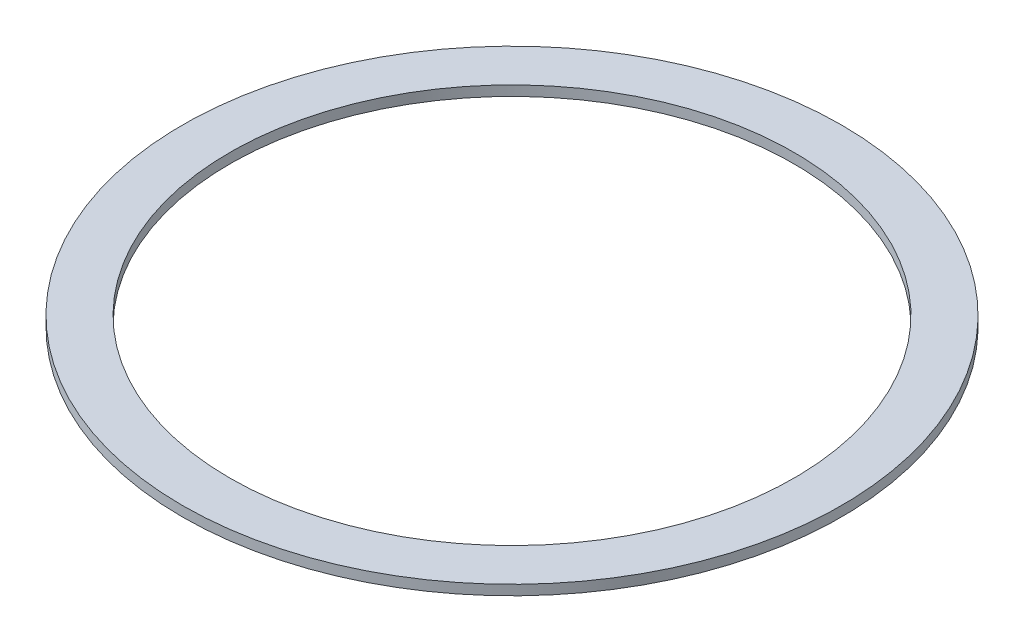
ISO-10303-21;
HEADER;
FILE_DESCRIPTION(('STEP AP214'),'2;1');
FILE_NAME('part.step','',(''),(''),'','','');
FILE_SCHEMA(('AUTOMOTIVE_DESIGN { 1 0 10303 214 1 1 1 1 }'));
ENDSEC;
DATA;
#1=APPLICATION_CONTEXT('core data for automotive mechanical design processes');
#2=APPLICATION_PROTOCOL_DEFINITION('international standard','automotive_design',2000,#1);
#3=PRODUCT_CONTEXT('',#1,'mechanical');
#4=PRODUCT('Part','Part','',(#3));
#5=PRODUCT_RELATED_PRODUCT_CATEGORY('part','',(#4));
#6=PRODUCT_DEFINITION_FORMATION('','',#4);
#7=PRODUCT_DEFINITION_CONTEXT('part definition',#1,'design');
#8=PRODUCT_DEFINITION('design','',#6,#7);
#9=PRODUCT_DEFINITION_SHAPE('','',#8);
#10=(LENGTH_UNIT() NAMED_UNIT(*) SI_UNIT(.MILLI.,.METRE.));
#11=(NAMED_UNIT(*) PLANE_ANGLE_UNIT() SI_UNIT($,.RADIAN.));
#12=(NAMED_UNIT(*) SI_UNIT($,.STERADIAN.) SOLID_ANGLE_UNIT());
#13=UNCERTAINTY_MEASURE_WITH_UNIT(LENGTH_MEASURE(1.E-05),#10,'distance_accuracy_value','');
#14=(GEOMETRIC_REPRESENTATION_CONTEXT(3) GLOBAL_UNCERTAINTY_ASSIGNED_CONTEXT((#13)) GLOBAL_UNIT_ASSIGNED_CONTEXT((#10,
#11,#12)) REPRESENTATION_CONTEXT('',''));
#15=CARTESIAN_POINT('',(0.,0.,0.));
#16=DIRECTION('',(0.,0.,1.));
#17=DIRECTION('',(1.,0.,0.));
#18=AXIS2_PLACEMENT_3D('',#15,#16,#17);
#19=CARTESIAN_POINT('',(0.,2.,0.));
#20=DIRECTION('',(0.,1.,0.));
#21=DIRECTION('',(0.,0.,1.));
#22=AXIS2_PLACEMENT_3D('',#19,#20,#21);
#23=PLANE('',#22);
#24=CARTESIAN_POINT('',(0.,2.,0.));
#25=DIRECTION('',(0.,1.,0.));
#26=DIRECTION('',(0.,0.,1.));
#27=AXIS2_PLACEMENT_3D('',#24,#25,#26);
#28=CIRCLE('',#27,66.);
#29=CARTESIAN_POINT('',(0.,2.,66.));
#30=VERTEX_POINT('',#29);
#31=EDGE_CURVE('E10',#30,#30,#28,.T.);
#32=ORIENTED_EDGE('',*,*,#31,.T.);
#33=EDGE_LOOP('',(#32));
#34=FACE_BOUND('',#33,.T.);
#35=CARTESIAN_POINT('',(0.,2.,0.));
#36=DIRECTION('',(0.,1.,0.));
#37=DIRECTION('',(0.,0.,1.));
#38=AXIS2_PLACEMENT_3D('',#35,#36,#37);
#39=CIRCLE('',#38,56.5);
#40=CARTESIAN_POINT('',(0.,2.,56.5));
#41=VERTEX_POINT('',#40);
#42=EDGE_CURVE('E39',#41,#41,#39,.T.);
#43=ORIENTED_EDGE('',*,*,#42,.F.);
#44=EDGE_LOOP('',(#43));
#45=FACE_BOUND('',#44,.T.);
#46=ADVANCED_FACE('F28',(#34,#45),#23,.T.);
#47=CARTESIAN_POINT('',(0.,0.,0.));
#48=DIRECTION('',(0.,1.,0.));
#49=DIRECTION('',(0.,0.,1.));
#50=AXIS2_PLACEMENT_3D('',#47,#48,#49);
#51=PLANE('',#50);
#52=CARTESIAN_POINT('',(0.,0.,0.));
#53=DIRECTION('',(0.,1.,0.));
#54=DIRECTION('',(0.,0.,1.));
#55=AXIS2_PLACEMENT_3D('',#52,#53,#54);
#56=CIRCLE('',#55,66.);
#57=CARTESIAN_POINT('',(0.,0.,66.));
#58=VERTEX_POINT('',#57);
#59=EDGE_CURVE('E35',#58,#58,#56,.T.);
#60=ORIENTED_EDGE('',*,*,#59,.F.);
#61=EDGE_LOOP('',(#60));
#62=FACE_BOUND('',#61,.T.);
#63=CARTESIAN_POINT('',(0.,0.,0.));
#64=DIRECTION('',(0.,1.,0.));
#65=DIRECTION('',(0.,0.,1.));
#66=AXIS2_PLACEMENT_3D('',#63,#64,#65);
#67=CIRCLE('',#66,56.5);
#68=CARTESIAN_POINT('',(0.,0.,56.5));
#69=VERTEX_POINT('',#68);
#70=EDGE_CURVE('E43',#69,#69,#67,.T.);
#71=ORIENTED_EDGE('',*,*,#70,.T.);
#72=EDGE_LOOP('',(#71));
#73=FACE_BOUND('',#72,.T.);
#74=ADVANCED_FACE('F49',(#62,#73),#51,.F.);
#75=CARTESIAN_POINT('',(0.,2.,0.));
#76=DIRECTION('',(0.,-1.,0.));
#77=DIRECTION('',(0.,0.,-1.));
#78=AXIS2_PLACEMENT_3D('',#75,#76,#77);
#79=CYLINDRICAL_SURFACE('',#78,66.);
#80=ORIENTED_EDGE('',*,*,#31,.F.);
#81=EDGE_LOOP('',(#80));
#82=FACE_BOUND('',#81,.T.);
#83=ORIENTED_EDGE('',*,*,#59,.T.);
#84=EDGE_LOOP('',(#83));
#85=FACE_BOUND('',#84,.T.);
#86=ADVANCED_FACE('F30',(#82,#85),#79,.T.);
#87=CARTESIAN_POINT('',(0.,2.,0.));
#88=DIRECTION('',(0.,-1.,0.));
#89=DIRECTION('',(0.,0.,-1.));
#90=AXIS2_PLACEMENT_3D('',#87,#88,#89);
#91=CYLINDRICAL_SURFACE('',#90,56.5);
#92=ORIENTED_EDGE('',*,*,#42,.T.);
#93=EDGE_LOOP('',(#92));
#94=FACE_BOUND('',#93,.T.);
#95=ORIENTED_EDGE('',*,*,#70,.F.);
#96=EDGE_LOOP('',(#95));
#97=FACE_BOUND('',#96,.T.);
#98=ADVANCED_FACE('F51',(#94,#97),#91,.F.);
#99=CLOSED_SHELL('',(#46,#74,#86,#98));
#100=MANIFOLD_SOLID_BREP('B2',#99);
#101=ADVANCED_BREP_SHAPE_REPRESENTATION('',(#18,#100),#14);
#102=SHAPE_DEFINITION_REPRESENTATION(#9,#101);
ENDSEC;
END-ISO-10303-21;
